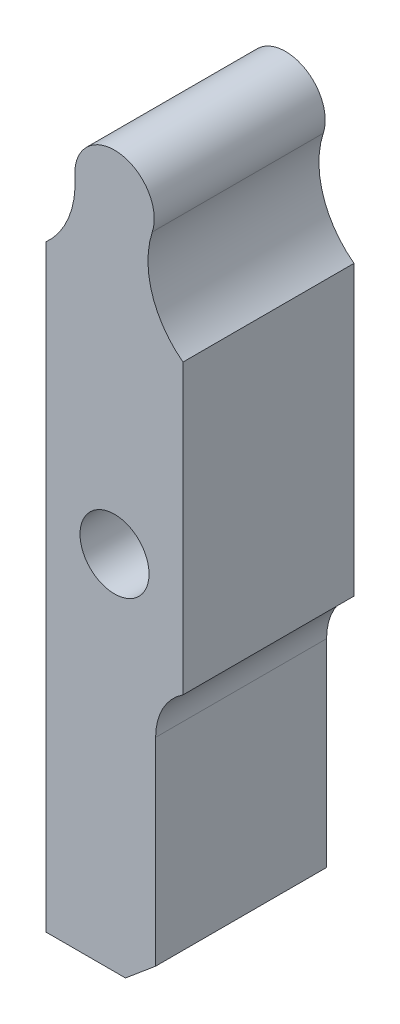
from build123d import *

# Parameters (mm, degrees)
SKETCH1_R           = 1.6002
BOSS_EXTRUDE1_DEPTH = 3.9624


with BuildPart() as part:
    # Sketch1 → Boss-Extrude1 (new, symmetric)
    with BuildSketch(Plane.XY):
        with BuildLine():
            Line((3.175, 12.7), (3.175, 26.0604))
            ThreePointArc((3.175, 26.0604), (1.739511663, 28.086628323), (1.750864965, 30.569791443))
            ThreePointArc((1.750864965, 30.569791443), (0.226108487, 32.967965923), (-1.837136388, 31.013702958))
            ThreePointArc((-1.837136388, 31.013702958), (-2.124877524, 29.208119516), (-3.175, 27.7114))
            Line((-3.175, 27.7114), (-3.175, 0))
            Line((-3.175, 0), (0.508, 0))
            Line((0.508, 0), (1.905, 1.172222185))
            Line((1.905, 1.172222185), (1.905, 10.358235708))
            ThreePointArc((1.905, 10.358235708), (2.24293689, 11.690222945), (3.175, 12.7))
        make_face()
        with Locations((0, 16.764)):
            Circle(SKETCH1_R, mode=Mode.SUBTRACT)
    extrude(amount=BOSS_EXTRUDE1_DEPTH, both=True)


solid = part.part
